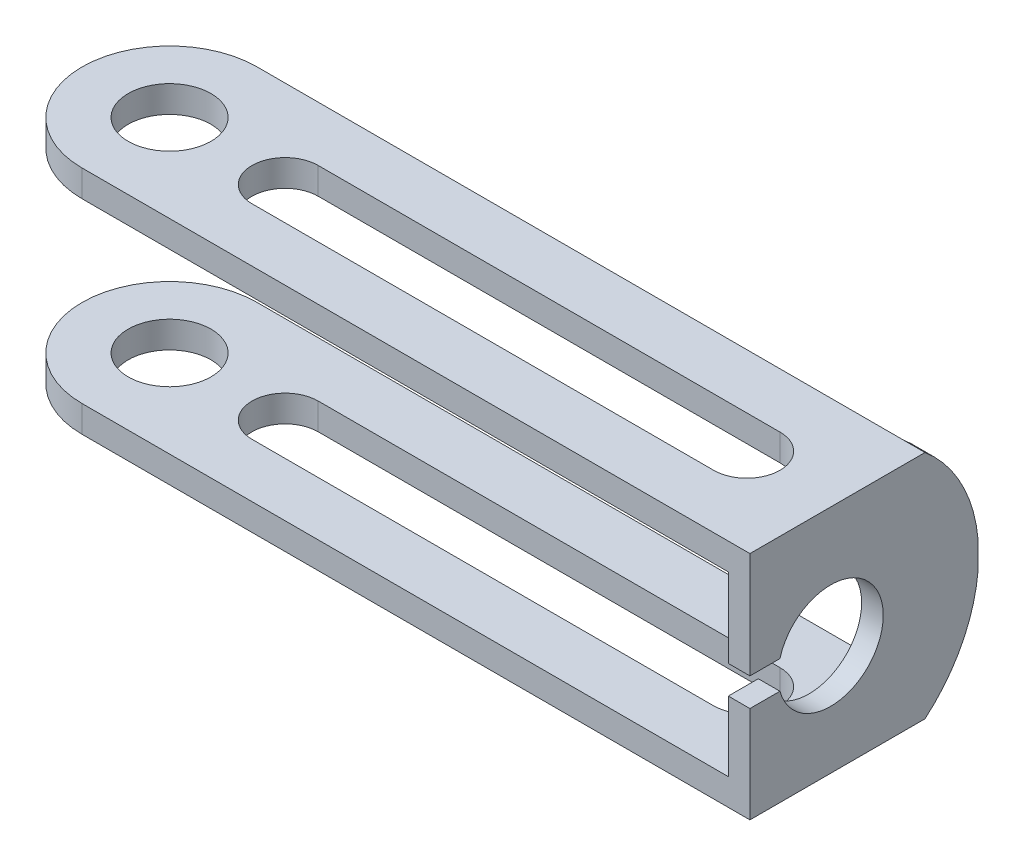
ISO-10303-21;
HEADER;
FILE_DESCRIPTION(('STEP AP214'),'2;1');
FILE_NAME('part.step','',(''),(''),'','','');
FILE_SCHEMA(('AUTOMOTIVE_DESIGN { 1 0 10303 214 1 1 1 1 }'));
ENDSEC;
DATA;
#1=APPLICATION_CONTEXT('core data for automotive mechanical design processes');
#2=APPLICATION_PROTOCOL_DEFINITION('international standard','automotive_design',2000,#1);
#3=PRODUCT_CONTEXT('',#1,'mechanical');
#4=PRODUCT('Part','Part','',(#3));
#5=PRODUCT_RELATED_PRODUCT_CATEGORY('part','',(#4));
#6=PRODUCT_DEFINITION_FORMATION('','',#4);
#7=PRODUCT_DEFINITION_CONTEXT('part definition',#1,'design');
#8=PRODUCT_DEFINITION('design','',#6,#7);
#9=PRODUCT_DEFINITION_SHAPE('','',#8);
#10=(LENGTH_UNIT() NAMED_UNIT(*) SI_UNIT(.MILLI.,.METRE.));
#11=(NAMED_UNIT(*) PLANE_ANGLE_UNIT() SI_UNIT($,.RADIAN.));
#12=(NAMED_UNIT(*) SI_UNIT($,.STERADIAN.) SOLID_ANGLE_UNIT());
#13=UNCERTAINTY_MEASURE_WITH_UNIT(LENGTH_MEASURE(1.E-05),#10,'distance_accuracy_value','');
#14=(GEOMETRIC_REPRESENTATION_CONTEXT(3) GLOBAL_UNCERTAINTY_ASSIGNED_CONTEXT((#13)) GLOBAL_UNIT_ASSIGNED_CONTEXT((#10,
#11,#12)) REPRESENTATION_CONTEXT('',''));
#15=CARTESIAN_POINT('',(0.,0.,0.));
#16=DIRECTION('',(0.,0.,1.));
#17=DIRECTION('',(1.,0.,0.));
#18=AXIS2_PLACEMENT_3D('',#15,#16,#17);
#19=CARTESIAN_POINT('',(260.445689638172,423.342237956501,30.));
#20=DIRECTION('',(0.,0.,-1.));
#21=DIRECTION('',(-1.,0.,0.));
#22=AXIS2_PLACEMENT_3D('',#19,#20,#21);
#23=PLANE('',#22);
#24=DIRECTION('',(0.,1.,0.));
#25=VECTOR('',#24,1.);
#26=CARTESIAN_POINT('',(333.805887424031,423.342237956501,30.));
#27=LINE('',#26,#25);
#28=CARTESIAN_POINT('',(333.805887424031,400.942177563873,30.));
#29=VERTEX_POINT('',#28);
#30=CARTESIAN_POINT('',(333.805887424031,410.30986522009,30.));
#31=VERTEX_POINT('',#30);
#32=EDGE_CURVE('E361',#29,#31,#27,.T.);
#33=ORIENTED_EDGE('',*,*,#32,.T.);
#34=DIRECTION('',(-1.,0.,0.));
#35=VECTOR('',#34,1.);
#36=CARTESIAN_POINT('',(260.445689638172,410.30986522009,30.));
#37=LINE('',#36,#35);
#38=CARTESIAN_POINT('',(331.705881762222,410.30986522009,30.));
#39=VERTEX_POINT('',#38);
#40=EDGE_CURVE('E386',#31,#39,#37,.T.);
#41=ORIENTED_EDGE('',*,*,#40,.T.);
#42=DIRECTION('',(0.,-1.,0.));
#43=VECTOR('',#42,1.);
#44=CARTESIAN_POINT('',(331.705881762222,420.752230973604,30.));
#45=LINE('',#44,#43);
#46=CARTESIAN_POINT('',(331.705881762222,403.53218454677,30.));
#47=VERTEX_POINT('',#46);
#48=EDGE_CURVE('E351',#39,#47,#45,.T.);
#49=ORIENTED_EDGE('',*,*,#48,.T.);
#50=DIRECTION('',(-1.,0.,0.));
#51=VECTOR('',#50,1.);
#52=CARTESIAN_POINT('',(331.705881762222,403.53218454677,30.));
#53=LINE('',#52,#51);
#54=CARTESIAN_POINT('',(268.946080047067,403.53218454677,30.));
#55=VERTEX_POINT('',#54);
#56=EDGE_CURVE('E355',#47,#55,#53,.T.);
#57=ORIENTED_EDGE('',*,*,#56,.T.);
#58=DIRECTION('',(0.,1.,0.));
#59=VECTOR('',#58,1.);
#60=CARTESIAN_POINT('',(268.946080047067,393.342237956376,30.));
#61=LINE('',#60,#59);
#62=CARTESIAN_POINT('',(268.946080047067,400.942177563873,30.));
#63=VERTEX_POINT('',#62);
#64=EDGE_CURVE('E382',#63,#55,#61,.T.);
#65=ORIENTED_EDGE('',*,*,#64,.F.);
#66=DIRECTION('',(1.,0.,0.));
#67=VECTOR('',#66,1.);
#68=CARTESIAN_POINT('',(260.445689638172,400.942177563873,30.));
#69=LINE('',#68,#67);
#70=EDGE_CURVE('E358',#63,#29,#69,.T.);
#71=ORIENTED_EDGE('',*,*,#70,.T.);
#72=EDGE_LOOP('',(#33,#41,#49,#57,#65,#71));
#73=FACE_BOUND('',#72,.T.);
#74=ADVANCED_FACE('F32',(#73),#23,.F.);
#75=CARTESIAN_POINT('',(331.705881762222,420.752230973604,30.));
#76=DIRECTION('',(0.,1.,0.));
#77=DIRECTION('',(0.,0.,1.));
#78=AXIS2_PLACEMENT_3D('',#75,#76,#77);
#79=PLANE('',#78);
#80=DIRECTION('',(-1.,0.,0.));
#81=VECTOR('',#80,1.);
#82=CARTESIAN_POINT('',(331.705881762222,420.752230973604,18.3217974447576));
#83=LINE('',#82,#81);
#84=CARTESIAN_POINT('',(325.044188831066,420.752230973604,18.3217974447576));
#85=VERTEX_POINT('',#84);
#86=CARTESIAN_POINT('',(280.205476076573,420.752230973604,18.3217974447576));
#87=VERTEX_POINT('',#86);
#88=EDGE_CURVE('E235',#85,#87,#83,.T.);
#89=ORIENTED_EDGE('',*,*,#88,.T.);
#90=CARTESIAN_POINT('',(280.205476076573,420.752230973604,21.5390766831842));
#91=DIRECTION('',(0.,1.,0.));
#92=DIRECTION('',(0.,0.,1.));
#93=AXIS2_PLACEMENT_3D('',#90,#91,#92);
#94=CIRCLE('',#93,3.21727923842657);
#95=CARTESIAN_POINT('',(280.205476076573,420.752230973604,24.7563559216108));
#96=VERTEX_POINT('',#95);
#97=EDGE_CURVE('E251',#87,#96,#94,.T.);
#98=ORIENTED_EDGE('',*,*,#97,.T.);
#99=DIRECTION('',(1.,0.,0.));
#100=VECTOR('',#99,1.);
#101=CARTESIAN_POINT('',(331.705881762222,420.752230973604,24.7563559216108));
#102=LINE('',#101,#100);
#103=CARTESIAN_POINT('',(325.044188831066,420.752230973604,24.7563559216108));
#104=VERTEX_POINT('',#103);
#105=EDGE_CURVE('E245',#96,#104,#102,.T.);
#106=ORIENTED_EDGE('',*,*,#105,.T.);
#107=CARTESIAN_POINT('',(325.044188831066,420.752230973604,21.5390766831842));
#108=DIRECTION('',(0.,1.,0.));
#109=DIRECTION('',(0.,0.,1.));
#110=AXIS2_PLACEMENT_3D('',#107,#108,#109);
#111=CIRCLE('',#110,3.21727923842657);
#112=EDGE_CURVE('E239',#104,#85,#111,.T.);
#113=ORIENTED_EDGE('',*,*,#112,.T.);
#114=EDGE_LOOP('',(#89,#98,#106,#113));
#115=FACE_BOUND('',#114,.T.);
#116=CARTESIAN_POINT('',(268.946080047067,420.752230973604,21.4996095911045));
#117=DIRECTION('',(0.,1.,0.));
#118=DIRECTION('',(0.,0.,1.));
#119=AXIS2_PLACEMENT_3D('',#116,#117,#118);
#120=CIRCLE('',#119,4.02146859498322);
#121=CARTESIAN_POINT('',(268.946080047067,420.752230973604,25.5210781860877));
#122=VERTEX_POINT('',#121);
#123=EDGE_CURVE('E263',#122,#122,#120,.T.);
#124=ORIENTED_EDGE('',*,*,#123,.T.);
#125=EDGE_LOOP('',(#124));
#126=FACE_BOUND('',#125,.T.);
#127=DIRECTION('',(0.,0.,1.));
#128=VECTOR('',#127,1.);
#129=CARTESIAN_POINT('',(331.629164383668,420.752230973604,30.));
#130=LINE('',#129,#128);
#131=CARTESIAN_POINT('',(331.629164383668,420.752230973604,10.5880069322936));
#132=VERTEX_POINT('',#131);
#133=CARTESIAN_POINT('',(331.629164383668,420.752230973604,12.999219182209));
#134=VERTEX_POINT('',#133);
#135=EDGE_CURVE('E341',#132,#134,#130,.T.);
#136=ORIENTED_EDGE('',*,*,#135,.F.);
#137=DIRECTION('',(-1.,0.,0.));
#138=VECTOR('',#137,1.);
#139=CARTESIAN_POINT('',(514.67758242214,420.752230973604,10.5880069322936));
#140=LINE('',#139,#138);
#141=CARTESIAN_POINT('',(331.705881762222,420.752230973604,10.5880069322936));
#142=VERTEX_POINT('',#141);
#143=EDGE_CURVE('E301',#132,#142,#140,.F.);
#144=ORIENTED_EDGE('',*,*,#143,.T.);
#145=DIRECTION('',(0.,0.,-1.));
#146=VECTOR('',#145,1.);
#147=CARTESIAN_POINT('',(331.705881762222,420.752230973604,30.));
#148=LINE('',#147,#146);
#149=CARTESIAN_POINT('',(331.705881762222,420.752230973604,30.));
#150=VERTEX_POINT('',#149);
#151=EDGE_CURVE('E376',#150,#142,#148,.T.);
#152=ORIENTED_EDGE('',*,*,#151,.F.);
#153=DIRECTION('',(1.,0.,0.));
#154=VECTOR('',#153,1.);
#155=CARTESIAN_POINT('',(331.705881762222,420.752230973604,30.));
#156=LINE('',#155,#154);
#157=CARTESIAN_POINT('',(268.946080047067,420.752230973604,30.));
#158=VERTEX_POINT('',#157);
#159=EDGE_CURVE('E349',#158,#150,#156,.T.);
#160=ORIENTED_EDGE('',*,*,#159,.F.);
#161=CARTESIAN_POINT('',(268.946080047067,420.752230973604,21.4996095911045));
#162=DIRECTION('',(0.,1.,0.));
#163=DIRECTION('',(0.,0.,1.));
#164=AXIS2_PLACEMENT_3D('',#161,#162,#163);
#165=CIRCLE('',#164,8.5003904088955);
#166=CARTESIAN_POINT('',(268.946080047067,420.752230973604,12.999219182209));
#167=VERTEX_POINT('',#166);
#168=EDGE_CURVE('E334',#167,#158,#165,.T.);
#169=ORIENTED_EDGE('',*,*,#168,.F.);
#170=DIRECTION('',(-1.,0.,0.));
#171=VECTOR('',#170,1.);
#172=CARTESIAN_POINT('',(331.705881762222,420.752230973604,12.999219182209));
#173=LINE('',#172,#171);
#174=EDGE_CURVE('E347',#134,#167,#173,.T.);
#175=ORIENTED_EDGE('',*,*,#174,.F.);
#176=EDGE_LOOP('',(#136,#144,#152,#160,#169,#175));
#177=FACE_BOUND('',#176,.T.);
#178=ADVANCED_FACE('F34',(#115,#126,#177),#79,.F.);
#179=CARTESIAN_POINT('',(331.705881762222,420.752230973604,30.));
#180=DIRECTION('',(1.,0.,0.));
#181=DIRECTION('',(0.,0.,-1.));
#182=AXIS2_PLACEMENT_3D('',#179,#180,#181);
#183=PLANE('',#182);
#184=ORIENTED_EDGE('',*,*,#48,.F.);
#185=DIRECTION('',(0.,0.,-1.));
#186=VECTOR('',#185,1.);
#187=CARTESIAN_POINT('',(331.705881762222,410.30986522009,30.));
#188=LINE('',#187,#186);
#189=CARTESIAN_POINT('',(331.705881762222,410.30986522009,27.0884362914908));
#190=VERTEX_POINT('',#189);
#191=EDGE_CURVE('E281',#39,#190,#188,.T.);
#192=ORIENTED_EDGE('',*,*,#191,.T.);
#193=CARTESIAN_POINT('',(331.705881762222,411.680823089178,22.1646351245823));
#194=DIRECTION('',(1.,0.,0.));
#195=DIRECTION('',(0.,0.,-1.));
#196=AXIS2_PLACEMENT_3D('',#193,#194,#195);
#197=CIRCLE('',#196,5.11110001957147);
#198=CARTESIAN_POINT('',(331.705881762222,413.051780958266,27.0884362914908));
#199=VERTEX_POINT('',#198);
#200=EDGE_CURVE('E284',#190,#199,#197,.T.);
#201=ORIENTED_EDGE('',*,*,#200,.T.);
#202=DIRECTION('',(0.,0.,1.));
#203=VECTOR('',#202,1.);
#204=CARTESIAN_POINT('',(331.705881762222,413.051780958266,30.));
#205=LINE('',#204,#203);
#206=CARTESIAN_POINT('',(331.705881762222,413.051780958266,30.));
#207=VERTEX_POINT('',#206);
#208=EDGE_CURVE('E277',#199,#207,#205,.T.);
#209=ORIENTED_EDGE('',*,*,#208,.T.);
#210=EDGE_CURVE('E352',#150,#207,#45,.T.);
#211=ORIENTED_EDGE('',*,*,#210,.F.);
#212=ORIENTED_EDGE('',*,*,#151,.T.);
#213=CARTESIAN_POINT('',(331.705881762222,412.142207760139,22.4331112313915));
#214=DIRECTION('',(1.,0.,0.));
#215=DIRECTION('',(0.,0.,-1.));
#216=AXIS2_PLACEMENT_3D('',#213,#214,#215);
#217=CIRCLE('',#216,14.6437357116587);
#218=CARTESIAN_POINT('',(331.705881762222,413.490436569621,7.85157240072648));
#219=VERTEX_POINT('',#218);
#220=EDGE_CURVE('E297',#142,#219,#217,.F.);
#221=ORIENTED_EDGE('',*,*,#220,.T.);
#222=DIRECTION('',(0.,1.,0.));
#223=VECTOR('',#222,1.);
#224=CARTESIAN_POINT('',(331.705881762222,420.752230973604,7.85157240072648));
#225=LINE('',#224,#223);
#226=CARTESIAN_POINT('',(331.705881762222,410.793978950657,7.85157240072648));
#227=VERTEX_POINT('',#226);
#228=EDGE_CURVE('E336',#227,#219,#225,.T.);
#229=ORIENTED_EDGE('',*,*,#228,.F.);
#230=CARTESIAN_POINT('',(331.705881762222,403.53218454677,10.5880069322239));
#231=VERTEX_POINT('',#230);
#232=EDGE_CURVE('E302',#227,#231,#217,.F.);
#233=ORIENTED_EDGE('',*,*,#232,.T.);
#234=DIRECTION('',(0.,0.,-1.));
#235=VECTOR('',#234,1.);
#236=CARTESIAN_POINT('',(331.705881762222,403.53218454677,30.));
#237=LINE('',#236,#235);
#238=EDGE_CURVE('E373',#47,#231,#237,.T.);
#239=ORIENTED_EDGE('',*,*,#238,.F.);
#240=EDGE_LOOP('',(#184,#192,#201,#209,#211,#212,#221,#229,#233,#239));
#241=FACE_BOUND('',#240,.T.);
#242=ADVANCED_FACE('F431',(#241),#183,.F.);
#243=CARTESIAN_POINT('',(331.705881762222,403.53218454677,30.));
#244=DIRECTION('',(0.,-1.,0.));
#245=DIRECTION('',(0.,0.,-1.));
#246=AXIS2_PLACEMENT_3D('',#243,#244,#245);
#247=PLANE('',#246);
#248=DIRECTION('',(-1.,0.,0.));
#249=VECTOR('',#248,1.);
#250=CARTESIAN_POINT('',(331.705881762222,403.53218454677,24.7563559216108));
#251=LINE('',#250,#249);
#252=CARTESIAN_POINT('',(325.044188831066,403.53218454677,24.7563559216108));
#253=VERTEX_POINT('',#252);
#254=CARTESIAN_POINT('',(280.205476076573,403.53218454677,24.7563559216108));
#255=VERTEX_POINT('',#254);
#256=EDGE_CURVE('E242',#253,#255,#251,.T.);
#257=ORIENTED_EDGE('',*,*,#256,.T.);
#258=CARTESIAN_POINT('',(280.205476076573,403.53218454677,21.5390766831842));
#259=DIRECTION('',(0.,-1.,0.));
#260=DIRECTION('',(0.,0.,-1.));
#261=AXIS2_PLACEMENT_3D('',#258,#259,#260);
#262=CIRCLE('',#261,3.21727923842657);
#263=CARTESIAN_POINT('',(280.205476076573,403.53218454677,18.3217974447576));
#264=VERTEX_POINT('',#263);
#265=EDGE_CURVE('E248',#255,#264,#262,.T.);
#266=ORIENTED_EDGE('',*,*,#265,.T.);
#267=DIRECTION('',(1.,0.,0.));
#268=VECTOR('',#267,1.);
#269=CARTESIAN_POINT('',(331.705881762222,403.53218454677,18.3217974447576));
#270=LINE('',#269,#268);
#271=CARTESIAN_POINT('',(325.044188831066,403.53218454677,18.3217974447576));
#272=VERTEX_POINT('',#271);
#273=EDGE_CURVE('E233',#264,#272,#270,.T.);
#274=ORIENTED_EDGE('',*,*,#273,.T.);
#275=CARTESIAN_POINT('',(325.044188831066,403.53218454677,21.5390766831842));
#276=DIRECTION('',(0.,-1.,0.));
#277=DIRECTION('',(0.,0.,-1.));
#278=AXIS2_PLACEMENT_3D('',#275,#276,#277);
#279=CIRCLE('',#278,3.21727923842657);
#280=EDGE_CURVE('E204',#272,#253,#279,.T.);
#281=ORIENTED_EDGE('',*,*,#280,.T.);
#282=EDGE_LOOP('',(#257,#266,#274,#281));
#283=FACE_BOUND('',#282,.T.);
#284=CARTESIAN_POINT('',(268.946080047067,403.53218454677,21.4996095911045));
#285=DIRECTION('',(0.,-1.,0.));
#286=DIRECTION('',(0.,0.,-1.));
#287=AXIS2_PLACEMENT_3D('',#284,#285,#286);
#288=CIRCLE('',#287,4.02146859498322);
#289=CARTESIAN_POINT('',(268.946080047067,403.53218454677,17.4781409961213));
#290=VERTEX_POINT('',#289);
#291=EDGE_CURVE('E260',#290,#290,#288,.T.);
#292=ORIENTED_EDGE('',*,*,#291,.T.);
#293=EDGE_LOOP('',(#292));
#294=FACE_BOUND('',#293,.T.);
#295=ORIENTED_EDGE('',*,*,#238,.T.);
#296=DIRECTION('',(-1.,0.,0.));
#297=VECTOR('',#296,1.);
#298=CARTESIAN_POINT('',(514.67758242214,403.53218454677,10.5880069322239));
#299=LINE('',#298,#297);
#300=CARTESIAN_POINT('',(331.629164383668,403.53218454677,10.5880069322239));
#301=VERTEX_POINT('',#300);
#302=EDGE_CURVE('E310',#231,#301,#299,.T.);
#303=ORIENTED_EDGE('',*,*,#302,.T.);
#304=DIRECTION('',(0.,0.,-1.));
#305=VECTOR('',#304,1.);
#306=CARTESIAN_POINT('',(331.629164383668,403.53218454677,30.));
#307=LINE('',#306,#305);
#308=CARTESIAN_POINT('',(331.629164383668,403.53218454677,12.999219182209));
#309=VERTEX_POINT('',#308);
#310=EDGE_CURVE('E338',#309,#301,#307,.T.);
#311=ORIENTED_EDGE('',*,*,#310,.F.);
#312=DIRECTION('',(1.,0.,0.));
#313=VECTOR('',#312,1.);
#314=CARTESIAN_POINT('',(331.705881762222,403.53218454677,12.999219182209));
#315=LINE('',#314,#313);
#316=CARTESIAN_POINT('',(268.946080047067,403.53218454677,12.999219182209));
#317=VERTEX_POINT('',#316);
#318=EDGE_CURVE('E345',#317,#309,#315,.T.);
#319=ORIENTED_EDGE('',*,*,#318,.F.);
#320=CARTESIAN_POINT('',(268.946080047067,403.53218454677,21.4996095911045));
#321=DIRECTION('',(0.,-1.,0.));
#322=DIRECTION('',(0.,0.,-1.));
#323=AXIS2_PLACEMENT_3D('',#320,#321,#322);
#324=CIRCLE('',#323,8.5003904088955);
#325=EDGE_CURVE('E332',#55,#317,#324,.T.);
#326=ORIENTED_EDGE('',*,*,#325,.F.);
#327=ORIENTED_EDGE('',*,*,#56,.F.);
#328=EDGE_LOOP('',(#295,#303,#311,#319,#326,#327));
#329=FACE_BOUND('',#328,.T.);
#330=ADVANCED_FACE('F507',(#283,#294,#329),#247,.F.);
#331=CARTESIAN_POINT('',(260.445689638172,400.942177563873,30.));
#332=DIRECTION('',(0.,1.,0.));
#333=DIRECTION('',(0.,0.,1.));
#334=AXIS2_PLACEMENT_3D('',#331,#332,#333);
#335=PLANE('',#334);
#336=DIRECTION('',(1.,0.,0.));
#337=VECTOR('',#336,1.);
#338=CARTESIAN_POINT('',(280.205476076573,400.94217756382,18.3217974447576));
#339=LINE('',#338,#337);
#340=CARTESIAN_POINT('',(280.205476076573,400.942177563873,18.3217974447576));
#341=VERTEX_POINT('',#340);
#342=CARTESIAN_POINT('',(325.044188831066,400.94217756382,18.3217974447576));
#343=VERTEX_POINT('',#342);
#344=EDGE_CURVE('E210',#341,#343,#339,.T.);
#345=ORIENTED_EDGE('',*,*,#344,.F.);
#346=CARTESIAN_POINT('',(280.205476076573,400.94217756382,21.5390766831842));
#347=DIRECTION('',(0.,-1.,0.));
#348=DIRECTION('',(0.,0.,-1.));
#349=AXIS2_PLACEMENT_3D('',#346,#347,#348);
#350=CIRCLE('',#349,3.21727923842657);
#351=CARTESIAN_POINT('',(280.205476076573,400.94217756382,24.7563559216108));
#352=VERTEX_POINT('',#351);
#353=EDGE_CURVE('E216',#352,#341,#350,.T.);
#354=ORIENTED_EDGE('',*,*,#353,.F.);
#355=DIRECTION('',(-1.,0.,0.));
#356=VECTOR('',#355,1.);
#357=CARTESIAN_POINT('',(280.205476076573,400.94217756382,24.7563559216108));
#358=LINE('',#357,#356);
#359=CARTESIAN_POINT('',(325.044188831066,400.94217756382,24.7563559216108));
#360=VERTEX_POINT('',#359);
#361=EDGE_CURVE('E221',#360,#352,#358,.T.);
#362=ORIENTED_EDGE('',*,*,#361,.F.);
#363=CARTESIAN_POINT('',(325.044188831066,400.94217756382,21.5390766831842));
#364=DIRECTION('',(0.,-1.,0.));
#365=DIRECTION('',(0.,0.,-1.));
#366=AXIS2_PLACEMENT_3D('',#363,#364,#365);
#367=CIRCLE('',#366,3.21727923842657);
#368=EDGE_CURVE('E201',#343,#360,#367,.T.);
#369=ORIENTED_EDGE('',*,*,#368,.F.);
#370=EDGE_LOOP('',(#345,#354,#362,#369));
#371=FACE_BOUND('',#370,.T.);
#372=CARTESIAN_POINT('',(268.946080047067,400.942177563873,21.4996095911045));
#373=DIRECTION('',(0.,-1.,0.));
#374=DIRECTION('',(0.,0.,-1.));
#375=AXIS2_PLACEMENT_3D('',#372,#373,#374);
#376=CIRCLE('',#375,4.02146859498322);
#377=CARTESIAN_POINT('',(268.946080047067,400.942177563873,17.4781409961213));
#378=VERTEX_POINT('',#377);
#379=EDGE_CURVE('E254',#378,#378,#376,.T.);
#380=ORIENTED_EDGE('',*,*,#379,.F.);
#381=EDGE_LOOP('',(#380));
#382=FACE_BOUND('',#381,.T.);
#383=DIRECTION('',(-1.,0.,0.));
#384=VECTOR('',#383,1.);
#385=CARTESIAN_POINT('',(260.445689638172,400.942177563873,12.999219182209));
#386=LINE('',#385,#384);
#387=CARTESIAN_POINT('',(331.629164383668,400.942177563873,12.999219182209));
#388=VERTEX_POINT('',#387);
#389=CARTESIAN_POINT('',(268.946080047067,400.942177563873,12.999219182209));
#390=VERTEX_POINT('',#389);
#391=EDGE_CURVE('E343',#388,#390,#386,.T.);
#392=ORIENTED_EDGE('',*,*,#391,.F.);
#393=DIRECTION('',(-1.,0.,0.));
#394=VECTOR('',#393,1.);
#395=CARTESIAN_POINT('',(514.67758242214,400.942177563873,12.999219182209));
#396=LINE('',#395,#394);
#397=CARTESIAN_POINT('',(333.805887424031,400.942177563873,12.999219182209));
#398=VERTEX_POINT('',#397);
#399=EDGE_CURVE('E287',#398,#388,#396,.T.);
#400=ORIENTED_EDGE('',*,*,#399,.F.);
#401=DIRECTION('',(0.,0.,-1.));
#402=VECTOR('',#401,1.);
#403=CARTESIAN_POINT('',(333.805887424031,400.942177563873,30.));
#404=LINE('',#403,#402);
#405=EDGE_CURVE('E370',#29,#398,#404,.T.);
#406=ORIENTED_EDGE('',*,*,#405,.F.);
#407=ORIENTED_EDGE('',*,*,#70,.F.);
#408=CARTESIAN_POINT('',(268.946080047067,400.942177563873,21.4996095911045));
#409=DIRECTION('',(0.,1.,0.));
#410=DIRECTION('',(0.,0.,1.));
#411=AXIS2_PLACEMENT_3D('',#408,#409,#410);
#412=CIRCLE('',#411,8.5003904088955);
#413=EDGE_CURVE('E330',#390,#63,#412,.T.);
#414=ORIENTED_EDGE('',*,*,#413,.F.);
#415=EDGE_LOOP('',(#392,#400,#406,#407,#414));
#416=FACE_BOUND('',#415,.T.);
#417=ADVANCED_FACE('F218',(#371,#382,#416),#335,.F.);
#418=CARTESIAN_POINT('',(333.805887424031,423.342237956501,30.));
#419=DIRECTION('',(-1.,0.,0.));
#420=DIRECTION('',(0.,0.,1.));
#421=AXIS2_PLACEMENT_3D('',#418,#419,#420);
#422=PLANE('',#421);
#423=CARTESIAN_POINT('',(333.805887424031,411.680823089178,22.1646351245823));
#424=DIRECTION('',(1.,0.,0.));
#425=DIRECTION('',(0.,0.,-1.));
#426=AXIS2_PLACEMENT_3D('',#423,#424,#425);
#427=CIRCLE('',#426,5.11110001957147);
#428=CARTESIAN_POINT('',(333.805887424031,410.30986522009,27.0884362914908));
#429=VERTEX_POINT('',#428);
#430=CARTESIAN_POINT('',(333.805887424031,413.051780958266,27.0884362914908));
#431=VERTEX_POINT('',#430);
#432=EDGE_CURVE('E266',#429,#431,#427,.T.);
#433=ORIENTED_EDGE('',*,*,#432,.F.);
#434=DIRECTION('',(0.,0.,-1.));
#435=VECTOR('',#434,1.);
#436=CARTESIAN_POINT('',(333.805887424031,410.30986522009,27.0884362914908));
#437=LINE('',#436,#435);
#438=EDGE_CURVE('E271',#31,#429,#437,.T.);
#439=ORIENTED_EDGE('',*,*,#438,.F.);
#440=ORIENTED_EDGE('',*,*,#32,.F.);
#441=ORIENTED_EDGE('',*,*,#405,.T.);
#442=CARTESIAN_POINT('',(333.805887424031,412.142207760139,22.4331112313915));
#443=DIRECTION('',(-1.,0.,0.));
#444=DIRECTION('',(0.,0.,1.));
#445=AXIS2_PLACEMENT_3D('',#442,#443,#444);
#446=CIRCLE('',#445,14.6437357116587);
#447=CARTESIAN_POINT('',(333.805887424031,410.793978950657,7.85157240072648));
#448=VERTEX_POINT('',#447);
#449=EDGE_CURVE('E298',#398,#448,#446,.F.);
#450=ORIENTED_EDGE('',*,*,#449,.T.);
#451=DIRECTION('',(0.,1.,0.));
#452=VECTOR('',#451,1.);
#453=CARTESIAN_POINT('',(333.805887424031,393.342237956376,7.85157240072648));
#454=LINE('',#453,#452);
#455=CARTESIAN_POINT('',(333.805887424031,413.490436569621,7.85157240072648));
#456=VERTEX_POINT('',#455);
#457=EDGE_CURVE('E320',#448,#456,#454,.T.);
#458=ORIENTED_EDGE('',*,*,#457,.T.);
#459=CARTESIAN_POINT('',(333.805887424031,423.342237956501,12.9992191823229));
#460=VERTEX_POINT('',#459);
#461=EDGE_CURVE('E295',#456,#460,#446,.F.);
#462=ORIENTED_EDGE('',*,*,#461,.T.);
#463=DIRECTION('',(0.,0.,-1.));
#464=VECTOR('',#463,1.);
#465=CARTESIAN_POINT('',(333.805887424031,423.342237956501,30.));
#466=LINE('',#465,#464);
#467=CARTESIAN_POINT('',(333.805887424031,423.342237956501,30.));
#468=VERTEX_POINT('',#467);
#469=EDGE_CURVE('E367',#468,#460,#466,.T.);
#470=ORIENTED_EDGE('',*,*,#469,.F.);
#471=CARTESIAN_POINT('',(333.805887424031,413.051780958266,30.));
#472=VERTEX_POINT('',#471);
#473=EDGE_CURVE('E360',#472,#468,#27,.T.);
#474=ORIENTED_EDGE('',*,*,#473,.F.);
#475=DIRECTION('',(0.,0.,1.));
#476=VECTOR('',#475,1.);
#477=CARTESIAN_POINT('',(333.805887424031,413.051780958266,27.0884362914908));
#478=LINE('',#477,#476);
#479=EDGE_CURVE('E269',#431,#472,#478,.T.);
#480=ORIENTED_EDGE('',*,*,#479,.F.);
#481=EDGE_LOOP('',(#433,#439,#440,#441,#450,#458,#462,#470,#474,#480));
#482=FACE_BOUND('',#481,.T.);
#483=ADVANCED_FACE('F444',(#482),#422,.F.);
#484=CARTESIAN_POINT('',(260.445689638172,423.342237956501,30.));
#485=DIRECTION('',(0.,-1.,0.));
#486=DIRECTION('',(0.,0.,-1.));
#487=AXIS2_PLACEMENT_3D('',#484,#485,#486);
#488=PLANE('',#487);
#489=DIRECTION('',(-1.,0.,0.));
#490=VECTOR('',#489,1.);
#491=CARTESIAN_POINT('',(260.445689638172,423.342237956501,24.7563559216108));
#492=LINE('',#491,#490);
#493=CARTESIAN_POINT('',(325.044188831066,423.342237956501,24.7563559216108));
#494=VERTEX_POINT('',#493);
#495=CARTESIAN_POINT('',(280.205476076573,423.342237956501,24.7563559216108));
#496=VERTEX_POINT('',#495);
#497=EDGE_CURVE('E40',#494,#496,#492,.T.);
#498=ORIENTED_EDGE('',*,*,#497,.T.);
#499=CARTESIAN_POINT('',(280.205476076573,423.342237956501,21.5390766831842));
#500=DIRECTION('',(0.,-1.,0.));
#501=DIRECTION('',(0.,0.,-1.));
#502=AXIS2_PLACEMENT_3D('',#499,#500,#501);
#503=CIRCLE('',#502,3.21727923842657);
#504=CARTESIAN_POINT('',(280.205476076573,423.342237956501,18.3217974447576));
#505=VERTEX_POINT('',#504);
#506=EDGE_CURVE('E11',#496,#505,#503,.T.);
#507=ORIENTED_EDGE('',*,*,#506,.T.);
#508=DIRECTION('',(1.,0.,0.));
#509=VECTOR('',#508,1.);
#510=CARTESIAN_POINT('',(260.445689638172,423.342237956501,18.3217974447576));
#511=LINE('',#510,#509);
#512=CARTESIAN_POINT('',(325.044188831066,423.342237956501,18.3217974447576));
#513=VERTEX_POINT('',#512);
#514=EDGE_CURVE('E389',#505,#513,#511,.T.);
#515=ORIENTED_EDGE('',*,*,#514,.T.);
#516=CARTESIAN_POINT('',(325.044188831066,423.342237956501,21.5390766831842));
#517=DIRECTION('',(0.,-1.,0.));
#518=DIRECTION('',(0.,0.,-1.));
#519=AXIS2_PLACEMENT_3D('',#516,#517,#518);
#520=CIRCLE('',#519,3.21727923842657);
#521=EDGE_CURVE('E392',#513,#494,#520,.T.);
#522=ORIENTED_EDGE('',*,*,#521,.T.);
#523=EDGE_LOOP('',(#498,#507,#515,#522));
#524=FACE_BOUND('',#523,.T.);
#525=CARTESIAN_POINT('',(268.946080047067,423.342237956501,21.4996095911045));
#526=DIRECTION('',(0.,-1.,0.));
#527=DIRECTION('',(0.,0.,-1.));
#528=AXIS2_PLACEMENT_3D('',#525,#526,#527);
#529=CIRCLE('',#528,4.02146859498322);
#530=CARTESIAN_POINT('',(268.946080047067,423.342237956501,17.4781409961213));
#531=VERTEX_POINT('',#530);
#532=EDGE_CURVE('E257',#531,#531,#529,.T.);
#533=ORIENTED_EDGE('',*,*,#532,.T.);
#534=EDGE_LOOP('',(#533));
#535=FACE_BOUND('',#534,.T.);
#536=ORIENTED_EDGE('',*,*,#469,.T.);
#537=DIRECTION('',(-1.,0.,0.));
#538=VECTOR('',#537,1.);
#539=CARTESIAN_POINT('',(514.67758242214,423.342237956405,12.999219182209));
#540=LINE('',#539,#538);
#541=CARTESIAN_POINT('',(331.629164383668,423.342237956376,12.999219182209));
#542=VERTEX_POINT('',#541);
#543=EDGE_CURVE('E288',#460,#542,#540,.T.);
#544=ORIENTED_EDGE('',*,*,#543,.T.);
#545=DIRECTION('',(-1.,0.,0.));
#546=VECTOR('',#545,1.);
#547=CARTESIAN_POINT('',(331.629164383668,423.342237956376,12.999219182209));
#548=LINE('',#547,#546);
#549=CARTESIAN_POINT('',(268.946080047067,423.342237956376,12.999219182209));
#550=VERTEX_POINT('',#549);
#551=EDGE_CURVE('E315',#542,#550,#548,.T.);
#552=ORIENTED_EDGE('',*,*,#551,.T.);
#553=CARTESIAN_POINT('',(268.946080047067,423.342237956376,21.4996095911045));
#554=DIRECTION('',(0.,1.,0.));
#555=DIRECTION('',(0.,0.,-1.));
#556=AXIS2_PLACEMENT_3D('',#553,#554,#555);
#557=CIRCLE('',#556,8.5003904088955);
#558=CARTESIAN_POINT('',(268.946080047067,423.342237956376,30.));
#559=VERTEX_POINT('',#558);
#560=EDGE_CURVE('E318',#550,#559,#557,.T.);
#561=ORIENTED_EDGE('',*,*,#560,.T.);
#562=DIRECTION('',(-1.,0.,0.));
#563=VECTOR('',#562,1.);
#564=CARTESIAN_POINT('',(260.445689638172,423.342237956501,30.));
#565=LINE('',#564,#563);
#566=EDGE_CURVE('E364',#468,#559,#565,.T.);
#567=ORIENTED_EDGE('',*,*,#566,.F.);
#568=EDGE_LOOP('',(#536,#544,#552,#561,#567));
#569=FACE_BOUND('',#568,.T.);
#570=ADVANCED_FACE('F396',(#524,#535,#569),#488,.F.);
#571=ORIENTED_EDGE('',*,*,#210,.T.);
#572=DIRECTION('',(1.,0.,0.));
#573=VECTOR('',#572,1.);
#574=CARTESIAN_POINT('',(260.445689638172,413.051780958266,30.));
#575=LINE('',#574,#573);
#576=EDGE_CURVE('E383',#207,#472,#575,.T.);
#577=ORIENTED_EDGE('',*,*,#576,.T.);
#578=ORIENTED_EDGE('',*,*,#473,.T.);
#579=ORIENTED_EDGE('',*,*,#566,.T.);
#580=EDGE_CURVE('E379',#158,#559,#61,.T.);
#581=ORIENTED_EDGE('',*,*,#580,.F.);
#582=ORIENTED_EDGE('',*,*,#159,.T.);
#583=EDGE_LOOP('',(#571,#577,#578,#579,#581,#582));
#584=FACE_BOUND('',#583,.T.);
#585=ADVANCED_FACE('F427',(#584),#23,.F.);
#586=CARTESIAN_POINT('',(331.629164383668,393.342237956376,12.999219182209));
#587=DIRECTION('',(0.,0.,-1.));
#588=DIRECTION('',(-1.,0.,0.));
#589=AXIS2_PLACEMENT_3D('',#586,#587,#588);
#590=PLANE('',#589);
#591=ORIENTED_EDGE('',*,*,#174,.T.);
#592=DIRECTION('',(0.,1.,0.));
#593=VECTOR('',#592,1.);
#594=CARTESIAN_POINT('',(268.946080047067,393.342237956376,12.999219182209));
#595=LINE('',#594,#593);
#596=EDGE_CURVE('E321',#167,#550,#595,.T.);
#597=ORIENTED_EDGE('',*,*,#596,.T.);
#598=ORIENTED_EDGE('',*,*,#551,.F.);
#599=DIRECTION('',(0.,1.,0.));
#600=VECTOR('',#599,1.);
#601=CARTESIAN_POINT('',(331.629164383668,393.342237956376,12.999219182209));
#602=LINE('',#601,#600);
#603=EDGE_CURVE('E325',#134,#542,#602,.T.);
#604=ORIENTED_EDGE('',*,*,#603,.F.);
#605=EDGE_LOOP('',(#591,#597,#598,#604));
#606=FACE_BOUND('',#605,.T.);
#607=ADVANCED_FACE('F435',(#606),#590,.T.);
#608=ORIENTED_EDGE('',*,*,#318,.T.);
#609=EDGE_CURVE('E324',#388,#309,#602,.T.);
#610=ORIENTED_EDGE('',*,*,#609,.F.);
#611=ORIENTED_EDGE('',*,*,#391,.T.);
#612=EDGE_CURVE('E323',#390,#317,#595,.T.);
#613=ORIENTED_EDGE('',*,*,#612,.T.);
#614=EDGE_LOOP('',(#608,#610,#611,#613));
#615=FACE_BOUND('',#614,.T.);
#616=ADVANCED_FACE('F441',(#615),#590,.T.);
#617=CARTESIAN_POINT('',(331.629164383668,393.342237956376,7.85157240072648));
#618=DIRECTION('',(-1.,0.,0.));
#619=DIRECTION('',(0.,0.,1.));
#620=AXIS2_PLACEMENT_3D('',#617,#618,#619);
#621=PLANE('',#620);
#622=CARTESIAN_POINT('',(331.629164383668,412.142207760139,22.4331112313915));
#623=DIRECTION('',(-1.,0.,0.));
#624=DIRECTION('',(0.,0.,1.));
#625=AXIS2_PLACEMENT_3D('',#622,#623,#624);
#626=CIRCLE('',#625,14.6437357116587);
#627=EDGE_CURVE('E304',#132,#542,#626,.F.);
#628=ORIENTED_EDGE('',*,*,#627,.F.);
#629=ORIENTED_EDGE('',*,*,#135,.T.);
#630=ORIENTED_EDGE('',*,*,#603,.T.);
#631=EDGE_LOOP('',(#628,#629,#630));
#632=FACE_BOUND('',#631,.T.);
#633=ADVANCED_FACE('F513',(#632),#621,.T.);
#634=CARTESIAN_POINT('',(331.629164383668,412.142207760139,22.4331112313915));
#635=DIRECTION('',(-1.,0.,0.));
#636=DIRECTION('',(0.,0.,1.));
#637=AXIS2_PLACEMENT_3D('',#634,#635,#636);
#638=CIRCLE('',#637,14.6437357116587);
#639=EDGE_CURVE('E312',#388,#301,#638,.F.);
#640=ORIENTED_EDGE('',*,*,#639,.F.);
#641=ORIENTED_EDGE('',*,*,#609,.T.);
#642=ORIENTED_EDGE('',*,*,#310,.T.);
#643=EDGE_LOOP('',(#640,#641,#642));
#644=FACE_BOUND('',#643,.T.);
#645=ADVANCED_FACE('F510',(#644),#621,.T.);
#646=CARTESIAN_POINT('',(333.805887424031,393.342237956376,7.85157240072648));
#647=DIRECTION('',(0.,0.,-1.));
#648=DIRECTION('',(-1.,0.,0.));
#649=AXIS2_PLACEMENT_3D('',#646,#647,#648);
#650=PLANE('',#649);
#651=DIRECTION('',(-1.,0.,0.));
#652=VECTOR('',#651,1.);
#653=CARTESIAN_POINT('',(514.67758242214,410.793978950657,7.85157240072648));
#654=LINE('',#653,#652);
#655=EDGE_CURVE('E307',#227,#448,#654,.F.);
#656=ORIENTED_EDGE('',*,*,#655,.F.);
#657=ORIENTED_EDGE('',*,*,#228,.T.);
#658=DIRECTION('',(-1.,0.,0.));
#659=VECTOR('',#658,1.);
#660=CARTESIAN_POINT('',(514.67758242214,413.490436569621,7.85157240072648));
#661=LINE('',#660,#659);
#662=EDGE_CURVE('E290',#456,#219,#661,.T.);
#663=ORIENTED_EDGE('',*,*,#662,.F.);
#664=ORIENTED_EDGE('',*,*,#457,.F.);
#665=EDGE_LOOP('',(#656,#657,#663,#664));
#666=FACE_BOUND('',#665,.T.);
#667=ADVANCED_FACE('F512',(#666),#650,.T.);
#668=CARTESIAN_POINT('',(268.946080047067,393.342237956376,21.4996095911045));
#669=DIRECTION('',(0.,1.,0.));
#670=DIRECTION('',(0.,0.,1.));
#671=AXIS2_PLACEMENT_3D('',#668,#669,#670);
#672=CYLINDRICAL_SURFACE('',#671,8.5003904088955);
#673=ORIENTED_EDGE('',*,*,#168,.T.);
#674=ORIENTED_EDGE('',*,*,#580,.T.);
#675=ORIENTED_EDGE('',*,*,#560,.F.);
#676=ORIENTED_EDGE('',*,*,#596,.F.);
#677=EDGE_LOOP('',(#673,#674,#675,#676));
#678=FACE_BOUND('',#677,.T.);
#679=ADVANCED_FACE('F471',(#678),#672,.T.);
#680=ORIENTED_EDGE('',*,*,#325,.T.);
#681=ORIENTED_EDGE('',*,*,#612,.F.);
#682=ORIENTED_EDGE('',*,*,#413,.T.);
#683=ORIENTED_EDGE('',*,*,#64,.T.);
#684=EDGE_LOOP('',(#680,#681,#682,#683));
#685=FACE_BOUND('',#684,.T.);
#686=ADVANCED_FACE('F502',(#685),#672,.T.);
#687=CARTESIAN_POINT('',(514.67758242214,412.142207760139,22.4331112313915));
#688=DIRECTION('',(-1.,0.,0.));
#689=DIRECTION('',(0.,0.,1.));
#690=AXIS2_PLACEMENT_3D('',#687,#688,#689);
#691=CYLINDRICAL_SURFACE('',#690,14.6437357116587);
#692=ORIENTED_EDGE('',*,*,#143,.F.);
#693=ORIENTED_EDGE('',*,*,#627,.T.);
#694=ORIENTED_EDGE('',*,*,#543,.F.);
#695=ORIENTED_EDGE('',*,*,#461,.F.);
#696=ORIENTED_EDGE('',*,*,#662,.T.);
#697=ORIENTED_EDGE('',*,*,#220,.F.);
#698=EDGE_LOOP('',(#692,#693,#694,#695,#696,#697));
#699=FACE_BOUND('',#698,.T.);
#700=ADVANCED_FACE('F478',(#699),#691,.T.);
#701=ORIENTED_EDGE('',*,*,#399,.T.);
#702=ORIENTED_EDGE('',*,*,#639,.T.);
#703=ORIENTED_EDGE('',*,*,#302,.F.);
#704=ORIENTED_EDGE('',*,*,#232,.F.);
#705=ORIENTED_EDGE('',*,*,#655,.T.);
#706=ORIENTED_EDGE('',*,*,#449,.F.);
#707=EDGE_LOOP('',(#701,#702,#703,#704,#705,#706));
#708=FACE_BOUND('',#707,.T.);
#709=ADVANCED_FACE('F486',(#708),#691,.T.);
#710=CARTESIAN_POINT('',(303.805887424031,411.680823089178,22.1646351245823));
#711=DIRECTION('',(1.,0.,0.));
#712=DIRECTION('',(0.,0.,-1.));
#713=AXIS2_PLACEMENT_3D('',#710,#711,#712);
#714=CYLINDRICAL_SURFACE('',#713,5.11110001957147);
#715=DIRECTION('',(1.,0.,0.));
#716=VECTOR('',#715,1.);
#717=CARTESIAN_POINT('',(303.805887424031,410.30986522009,27.0884362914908));
#718=LINE('',#717,#716);
#719=EDGE_CURVE('E275',#190,#429,#718,.T.);
#720=ORIENTED_EDGE('',*,*,#719,.T.);
#721=ORIENTED_EDGE('',*,*,#432,.T.);
#722=DIRECTION('',(1.,0.,0.));
#723=VECTOR('',#722,1.);
#724=CARTESIAN_POINT('',(303.805887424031,413.051780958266,27.0884362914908));
#725=LINE('',#724,#723);
#726=EDGE_CURVE('E274',#199,#431,#725,.T.);
#727=ORIENTED_EDGE('',*,*,#726,.F.);
#728=ORIENTED_EDGE('',*,*,#200,.F.);
#729=EDGE_LOOP('',(#720,#721,#727,#728));
#730=FACE_BOUND('',#729,.T.);
#731=ADVANCED_FACE('F457',(#730),#714,.F.);
#732=CARTESIAN_POINT('',(303.805887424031,410.30986522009,27.0884362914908));
#733=DIRECTION('',(0.,-1.,0.));
#734=DIRECTION('',(0.,0.,-1.));
#735=AXIS2_PLACEMENT_3D('',#732,#733,#734);
#736=PLANE('',#735);
#737=ORIENTED_EDGE('',*,*,#40,.F.);
#738=ORIENTED_EDGE('',*,*,#438,.T.);
#739=ORIENTED_EDGE('',*,*,#719,.F.);
#740=ORIENTED_EDGE('',*,*,#191,.F.);
#741=EDGE_LOOP('',(#737,#738,#739,#740));
#742=FACE_BOUND('',#741,.T.);
#743=ADVANCED_FACE('F527',(#742),#736,.F.);
#744=CARTESIAN_POINT('',(303.805887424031,413.051780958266,27.0884362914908));
#745=DIRECTION('',(0.,1.,0.));
#746=DIRECTION('',(0.,0.,1.));
#747=AXIS2_PLACEMENT_3D('',#744,#745,#746);
#748=PLANE('',#747);
#749=ORIENTED_EDGE('',*,*,#726,.T.);
#750=ORIENTED_EDGE('',*,*,#479,.T.);
#751=ORIENTED_EDGE('',*,*,#576,.F.);
#752=ORIENTED_EDGE('',*,*,#208,.F.);
#753=EDGE_LOOP('',(#749,#750,#751,#752));
#754=FACE_BOUND('',#753,.T.);
#755=ADVANCED_FACE('F455',(#754),#748,.F.);
#756=CARTESIAN_POINT('',(268.946080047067,423.342237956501,21.4996095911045));
#757=DIRECTION('',(0.,-1.,0.));
#758=DIRECTION('',(0.,0.,-1.));
#759=AXIS2_PLACEMENT_3D('',#756,#757,#758);
#760=CYLINDRICAL_SURFACE('',#759,4.02146859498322);
#761=ORIENTED_EDGE('',*,*,#532,.F.);
#762=EDGE_LOOP('',(#761));
#763=FACE_BOUND('',#762,.T.);
#764=ORIENTED_EDGE('',*,*,#123,.F.);
#765=EDGE_LOOP('',(#764));
#766=FACE_BOUND('',#765,.T.);
#767=ADVANCED_FACE('F530',(#763,#766),#760,.F.);
#768=ORIENTED_EDGE('',*,*,#379,.T.);
#769=EDGE_LOOP('',(#768));
#770=FACE_BOUND('',#769,.T.);
#771=ORIENTED_EDGE('',*,*,#291,.F.);
#772=EDGE_LOOP('',(#771));
#773=FACE_BOUND('',#772,.T.);
#774=ADVANCED_FACE('F534',(#770,#773),#760,.F.);
#775=CARTESIAN_POINT('',(280.205476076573,430.94217756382,18.3217974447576));
#776=DIRECTION('',(0.,0.,-1.));
#777=DIRECTION('',(-1.,0.,0.));
#778=AXIS2_PLACEMENT_3D('',#775,#776,#777);
#779=PLANE('',#778);
#780=DIRECTION('',(0.,-1.,0.));
#781=VECTOR('',#780,1.);
#782=CARTESIAN_POINT('',(325.044188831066,430.94217756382,18.3217974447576));
#783=LINE('',#782,#781);
#784=EDGE_CURVE('E206',#513,#85,#783,.T.);
#785=ORIENTED_EDGE('',*,*,#784,.F.);
#786=ORIENTED_EDGE('',*,*,#514,.F.);
#787=DIRECTION('',(0.,-1.,0.));
#788=VECTOR('',#787,1.);
#789=CARTESIAN_POINT('',(280.205476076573,430.94217756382,18.3217974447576));
#790=LINE('',#789,#788);
#791=EDGE_CURVE('E47',#505,#87,#790,.T.);
#792=ORIENTED_EDGE('',*,*,#791,.T.);
#793=ORIENTED_EDGE('',*,*,#88,.F.);
#794=EDGE_LOOP('',(#785,#786,#792,#793));
#795=FACE_BOUND('',#794,.T.);
#796=ADVANCED_FACE('F539',(#795),#779,.F.);
#797=CARTESIAN_POINT('',(325.044188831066,430.94217756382,21.5390766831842));
#798=DIRECTION('',(0.,-1.,0.));
#799=DIRECTION('',(0.,0.,-1.));
#800=AXIS2_PLACEMENT_3D('',#797,#798,#799);
#801=CYLINDRICAL_SURFACE('',#800,3.21727923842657);
#802=DIRECTION('',(0.,-1.,0.));
#803=VECTOR('',#802,1.);
#804=CARTESIAN_POINT('',(325.044188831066,430.94217756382,24.7563559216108));
#805=LINE('',#804,#803);
#806=EDGE_CURVE('E229',#494,#104,#805,.T.);
#807=ORIENTED_EDGE('',*,*,#806,.F.);
#808=ORIENTED_EDGE('',*,*,#521,.F.);
#809=ORIENTED_EDGE('',*,*,#784,.T.);
#810=ORIENTED_EDGE('',*,*,#112,.F.);
#811=EDGE_LOOP('',(#807,#808,#809,#810));
#812=FACE_BOUND('',#811,.T.);
#813=ADVANCED_FACE('F406',(#812),#801,.F.);
#814=CARTESIAN_POINT('',(280.205476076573,430.94217756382,24.7563559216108));
#815=DIRECTION('',(0.,0.,1.));
#816=DIRECTION('',(1.,0.,0.));
#817=AXIS2_PLACEMENT_3D('',#814,#815,#816);
#818=PLANE('',#817);
#819=DIRECTION('',(0.,-1.,0.));
#820=VECTOR('',#819,1.);
#821=CARTESIAN_POINT('',(280.205476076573,430.94217756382,24.7563559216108));
#822=LINE('',#821,#820);
#823=EDGE_CURVE('E228',#496,#96,#822,.T.);
#824=ORIENTED_EDGE('',*,*,#823,.F.);
#825=ORIENTED_EDGE('',*,*,#497,.F.);
#826=ORIENTED_EDGE('',*,*,#806,.T.);
#827=ORIENTED_EDGE('',*,*,#105,.F.);
#828=EDGE_LOOP('',(#824,#825,#826,#827));
#829=FACE_BOUND('',#828,.T.);
#830=ADVANCED_FACE('F403',(#829),#818,.F.);
#831=CARTESIAN_POINT('',(280.205476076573,430.94217756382,21.5390766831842));
#832=DIRECTION('',(0.,-1.,0.));
#833=DIRECTION('',(0.,0.,-1.));
#834=AXIS2_PLACEMENT_3D('',#831,#832,#833);
#835=CYLINDRICAL_SURFACE('',#834,3.21727923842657);
#836=ORIENTED_EDGE('',*,*,#791,.F.);
#837=ORIENTED_EDGE('',*,*,#506,.F.);
#838=ORIENTED_EDGE('',*,*,#823,.T.);
#839=ORIENTED_EDGE('',*,*,#97,.F.);
#840=EDGE_LOOP('',(#836,#837,#838,#839));
#841=FACE_BOUND('',#840,.T.);
#842=ADVANCED_FACE('F411',(#841),#835,.F.);
#843=EDGE_CURVE('E226',#255,#352,#822,.T.);
#844=ORIENTED_EDGE('',*,*,#843,.T.);
#845=ORIENTED_EDGE('',*,*,#353,.T.);
#846=EDGE_CURVE('E213',#264,#341,#790,.T.);
#847=ORIENTED_EDGE('',*,*,#846,.F.);
#848=ORIENTED_EDGE('',*,*,#265,.F.);
#849=EDGE_LOOP('',(#844,#845,#847,#848));
#850=FACE_BOUND('',#849,.T.);
#851=ADVANCED_FACE('F413',(#850),#835,.F.);
#852=EDGE_CURVE('E230',#253,#360,#805,.T.);
#853=ORIENTED_EDGE('',*,*,#852,.T.);
#854=ORIENTED_EDGE('',*,*,#361,.T.);
#855=ORIENTED_EDGE('',*,*,#843,.F.);
#856=ORIENTED_EDGE('',*,*,#256,.F.);
#857=EDGE_LOOP('',(#853,#854,#855,#856));
#858=FACE_BOUND('',#857,.T.);
#859=ADVANCED_FACE('F419',(#858),#818,.F.);
#860=EDGE_CURVE('E55',#272,#343,#783,.T.);
#861=ORIENTED_EDGE('',*,*,#860,.T.);
#862=ORIENTED_EDGE('',*,*,#368,.T.);
#863=ORIENTED_EDGE('',*,*,#852,.F.);
#864=ORIENTED_EDGE('',*,*,#280,.F.);
#865=EDGE_LOOP('',(#861,#862,#863,#864));
#866=FACE_BOUND('',#865,.T.);
#867=ADVANCED_FACE('F198',(#866),#801,.F.);
#868=ORIENTED_EDGE('',*,*,#846,.T.);
#869=ORIENTED_EDGE('',*,*,#344,.T.);
#870=ORIENTED_EDGE('',*,*,#860,.F.);
#871=ORIENTED_EDGE('',*,*,#273,.F.);
#872=EDGE_LOOP('',(#868,#869,#870,#871));
#873=FACE_BOUND('',#872,.T.);
#874=ADVANCED_FACE('F211',(#873),#779,.F.);
#875=CLOSED_SHELL('',(#74,#178,#242,#330,#417,#483,#570,#585,#607,#616,#633,#645,#667,#679,#686,
#700,#709,#731,#743,#755,#767,#774,#796,#813,#830,#842,#851,#859,#867,#874));
#876=MANIFOLD_SOLID_BREP('B2',#875);
#877=ADVANCED_BREP_SHAPE_REPRESENTATION('',(#18,#876),#14);
#878=SHAPE_DEFINITION_REPRESENTATION(#9,#877);
ENDSEC;
END-ISO-10303-21;
